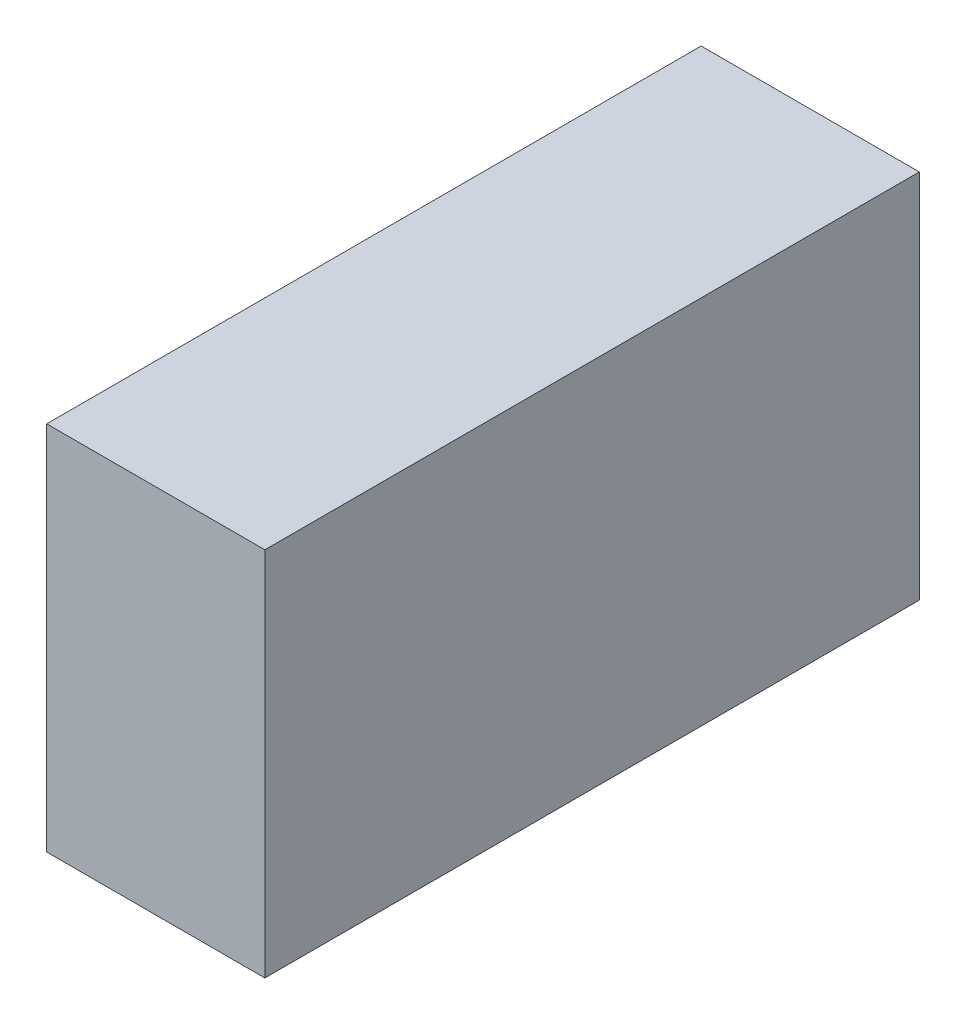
ISO-10303-21;
HEADER;
FILE_DESCRIPTION(('STEP AP214'),'2;1');
FILE_NAME('part.step','',(''),(''),'','','');
FILE_SCHEMA(('AUTOMOTIVE_DESIGN { 1 0 10303 214 1 1 1 1 }'));
ENDSEC;
DATA;
#1=APPLICATION_CONTEXT('core data for automotive mechanical design processes');
#2=APPLICATION_PROTOCOL_DEFINITION('international standard','automotive_design',2000,#1);
#3=PRODUCT_CONTEXT('',#1,'mechanical');
#4=PRODUCT('Part','Part','',(#3));
#5=PRODUCT_RELATED_PRODUCT_CATEGORY('part','',(#4));
#6=PRODUCT_DEFINITION_FORMATION('','',#4);
#7=PRODUCT_DEFINITION_CONTEXT('part definition',#1,'design');
#8=PRODUCT_DEFINITION('design','',#6,#7);
#9=PRODUCT_DEFINITION_SHAPE('','',#8);
#10=(LENGTH_UNIT() NAMED_UNIT(*) SI_UNIT(.MILLI.,.METRE.));
#11=(NAMED_UNIT(*) PLANE_ANGLE_UNIT() SI_UNIT($,.RADIAN.));
#12=(NAMED_UNIT(*) SI_UNIT($,.STERADIAN.) SOLID_ANGLE_UNIT());
#13=UNCERTAINTY_MEASURE_WITH_UNIT(LENGTH_MEASURE(1.E-05),#10,'distance_accuracy_value','');
#14=(GEOMETRIC_REPRESENTATION_CONTEXT(3) GLOBAL_UNCERTAINTY_ASSIGNED_CONTEXT((#13)) GLOBAL_UNIT_ASSIGNED_CONTEXT((#10,
#11,#12)) REPRESENTATION_CONTEXT('',''));
#15=CARTESIAN_POINT('',(0.,0.,0.));
#16=DIRECTION('',(0.,0.,1.));
#17=DIRECTION('',(1.,0.,0.));
#18=AXIS2_PLACEMENT_3D('',#15,#16,#17);
#19=CARTESIAN_POINT('',(0.,170.,0.));
#20=DIRECTION('',(1.,0.,0.));
#21=DIRECTION('',(0.,0.,-1.));
#22=AXIS2_PLACEMENT_3D('',#19,#20,#21);
#23=PLANE('',#22);
#24=DIRECTION('',(0.,0.,1.));
#25=VECTOR('',#24,1.);
#26=CARTESIAN_POINT('',(0.,0.,0.));
#27=LINE('',#26,#25);
#28=CARTESIAN_POINT('',(0.,0.,-300.));
#29=VERTEX_POINT('',#28);
#30=CARTESIAN_POINT('',(0.,0.,0.));
#31=VERTEX_POINT('',#30);
#32=EDGE_CURVE('E70',#29,#31,#27,.T.);
#33=ORIENTED_EDGE('',*,*,#32,.T.);
#34=DIRECTION('',(0.,-1.,0.));
#35=VECTOR('',#34,1.);
#36=CARTESIAN_POINT('',(0.,170.,0.));
#37=LINE('',#36,#35);
#38=CARTESIAN_POINT('',(0.,170.,0.));
#39=VERTEX_POINT('',#38);
#40=EDGE_CURVE('E11',#39,#31,#37,.T.);
#41=ORIENTED_EDGE('',*,*,#40,.F.);
#42=DIRECTION('',(0.,0.,1.));
#43=VECTOR('',#42,1.);
#44=CARTESIAN_POINT('',(0.,170.,0.));
#45=LINE('',#44,#43);
#46=CARTESIAN_POINT('',(0.,170.,-300.));
#47=VERTEX_POINT('',#46);
#48=EDGE_CURVE('E88',#47,#39,#45,.T.);
#49=ORIENTED_EDGE('',*,*,#48,.F.);
#50=DIRECTION('',(0.,-1.,0.));
#51=VECTOR('',#50,1.);
#52=CARTESIAN_POINT('',(0.,170.,-300.));
#53=LINE('',#52,#51);
#54=EDGE_CURVE('E82',#47,#29,#53,.T.);
#55=ORIENTED_EDGE('',*,*,#54,.T.);
#56=EDGE_LOOP('',(#33,#41,#49,#55));
#57=FACE_BOUND('',#56,.T.);
#58=ADVANCED_FACE('F26',(#57),#23,.F.);
#59=CARTESIAN_POINT('',(0.,170.,0.));
#60=DIRECTION('',(0.,0.,-1.));
#61=DIRECTION('',(-1.,0.,0.));
#62=AXIS2_PLACEMENT_3D('',#59,#60,#61);
#63=PLANE('',#62);
#64=DIRECTION('',(1.,0.,0.));
#65=VECTOR('',#64,1.);
#66=CARTESIAN_POINT('',(0.,0.,0.));
#67=LINE('',#66,#65);
#68=CARTESIAN_POINT('',(100.,0.,0.));
#69=VERTEX_POINT('',#68);
#70=EDGE_CURVE('E66',#31,#69,#67,.T.);
#71=ORIENTED_EDGE('',*,*,#70,.T.);
#72=DIRECTION('',(0.,-1.,0.));
#73=VECTOR('',#72,1.);
#74=CARTESIAN_POINT('',(100.,170.,0.));
#75=LINE('',#74,#73);
#76=CARTESIAN_POINT('',(100.,170.,0.));
#77=VERTEX_POINT('',#76);
#78=EDGE_CURVE('E33',#77,#69,#75,.T.);
#79=ORIENTED_EDGE('',*,*,#78,.F.);
#80=DIRECTION('',(1.,0.,0.));
#81=VECTOR('',#80,1.);
#82=CARTESIAN_POINT('',(0.,170.,0.));
#83=LINE('',#82,#81);
#84=EDGE_CURVE('E78',#39,#77,#83,.T.);
#85=ORIENTED_EDGE('',*,*,#84,.F.);
#86=ORIENTED_EDGE('',*,*,#40,.T.);
#87=EDGE_LOOP('',(#71,#79,#85,#86));
#88=FACE_BOUND('',#87,.T.);
#89=ADVANCED_FACE('F77',(#88),#63,.F.);
#90=CARTESIAN_POINT('',(100.,170.,0.));
#91=DIRECTION('',(-1.,0.,0.));
#92=DIRECTION('',(0.,0.,1.));
#93=AXIS2_PLACEMENT_3D('',#90,#91,#92);
#94=PLANE('',#93);
#95=DIRECTION('',(0.,0.,-1.));
#96=VECTOR('',#95,1.);
#97=CARTESIAN_POINT('',(100.,0.,0.));
#98=LINE('',#97,#96);
#99=CARTESIAN_POINT('',(100.,0.,-300.));
#100=VERTEX_POINT('',#99);
#101=EDGE_CURVE('E71',#69,#100,#98,.T.);
#102=ORIENTED_EDGE('',*,*,#101,.T.);
#103=DIRECTION('',(0.,-1.,0.));
#104=VECTOR('',#103,1.);
#105=CARTESIAN_POINT('',(100.,170.,-300.));
#106=LINE('',#105,#104);
#107=CARTESIAN_POINT('',(100.,170.,-300.));
#108=VERTEX_POINT('',#107);
#109=EDGE_CURVE('E94',#108,#100,#106,.T.);
#110=ORIENTED_EDGE('',*,*,#109,.F.);
#111=DIRECTION('',(0.,0.,-1.));
#112=VECTOR('',#111,1.);
#113=CARTESIAN_POINT('',(100.,170.,0.));
#114=LINE('',#113,#112);
#115=EDGE_CURVE('E45',#77,#108,#114,.T.);
#116=ORIENTED_EDGE('',*,*,#115,.F.);
#117=ORIENTED_EDGE('',*,*,#78,.T.);
#118=EDGE_LOOP('',(#102,#110,#116,#117));
#119=FACE_BOUND('',#118,.T.);
#120=ADVANCED_FACE('F97',(#119),#94,.F.);
#121=CARTESIAN_POINT('',(0.,170.,-300.));
#122=DIRECTION('',(0.,0.,1.));
#123=DIRECTION('',(1.,0.,0.));
#124=AXIS2_PLACEMENT_3D('',#121,#122,#123);
#125=PLANE('',#124);
#126=DIRECTION('',(-1.,0.,0.));
#127=VECTOR('',#126,1.);
#128=CARTESIAN_POINT('',(0.,0.,-300.));
#129=LINE('',#128,#127);
#130=EDGE_CURVE('E86',#100,#29,#129,.T.);
#131=ORIENTED_EDGE('',*,*,#130,.T.);
#132=ORIENTED_EDGE('',*,*,#54,.F.);
#133=DIRECTION('',(-1.,0.,0.));
#134=VECTOR('',#133,1.);
#135=CARTESIAN_POINT('',(0.,170.,-300.));
#136=LINE('',#135,#134);
#137=EDGE_CURVE('E40',#108,#47,#136,.T.);
#138=ORIENTED_EDGE('',*,*,#137,.F.);
#139=ORIENTED_EDGE('',*,*,#109,.T.);
#140=EDGE_LOOP('',(#131,#132,#138,#139));
#141=FACE_BOUND('',#140,.T.);
#142=ADVANCED_FACE('F99',(#141),#125,.F.);
#143=CARTESIAN_POINT('',(0.,170.,-300.));
#144=DIRECTION('',(0.,-1.,0.));
#145=DIRECTION('',(0.,0.,-1.));
#146=AXIS2_PLACEMENT_3D('',#143,#144,#145);
#147=PLANE('',#146);
#148=ORIENTED_EDGE('',*,*,#48,.T.);
#149=ORIENTED_EDGE('',*,*,#84,.T.);
#150=ORIENTED_EDGE('',*,*,#115,.T.);
#151=ORIENTED_EDGE('',*,*,#137,.T.);
#152=EDGE_LOOP('',(#148,#149,#150,#151));
#153=FACE_BOUND('',#152,.T.);
#154=ADVANCED_FACE('F100',(#153),#147,.F.);
#155=CARTESIAN_POINT('',(0.,0.,-300.));
#156=DIRECTION('',(0.,-1.,0.));
#157=DIRECTION('',(0.,0.,-1.));
#158=AXIS2_PLACEMENT_3D('',#155,#156,#157);
#159=PLANE('',#158);
#160=ORIENTED_EDGE('',*,*,#32,.F.);
#161=ORIENTED_EDGE('',*,*,#130,.F.);
#162=ORIENTED_EDGE('',*,*,#101,.F.);
#163=ORIENTED_EDGE('',*,*,#70,.F.);
#164=EDGE_LOOP('',(#160,#161,#162,#163));
#165=FACE_BOUND('',#164,.T.);
#166=ADVANCED_FACE('F67',(#165),#159,.T.);
#167=CLOSED_SHELL('',(#58,#89,#120,#142,#154,#166));
#168=MANIFOLD_SOLID_BREP('B2',#167);
#169=ADVANCED_BREP_SHAPE_REPRESENTATION('',(#18,#168),#14);
#170=SHAPE_DEFINITION_REPRESENTATION(#9,#169);
ENDSEC;
END-ISO-10303-21;
